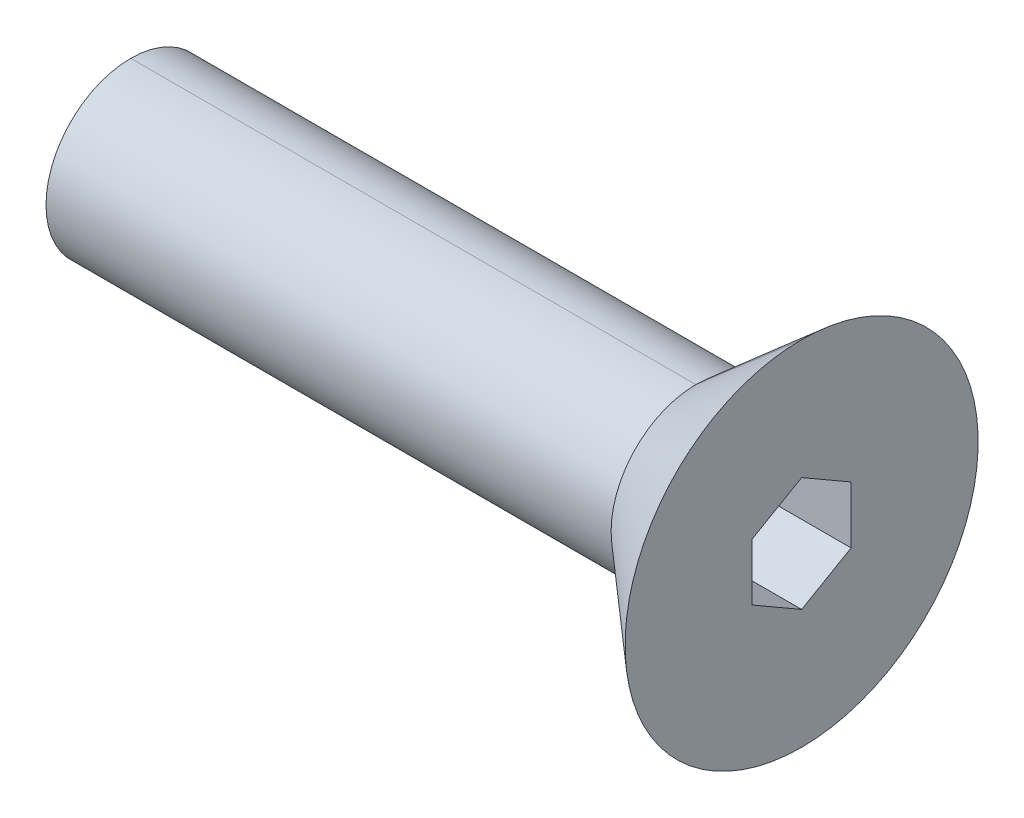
ISO-10303-21;
HEADER;
FILE_DESCRIPTION(('STEP AP214'),'2;1');
FILE_NAME('part.step','',(''),(''),'','','');
FILE_SCHEMA(('AUTOMOTIVE_DESIGN { 1 0 10303 214 1 1 1 1 }'));
ENDSEC;
DATA;
#1=APPLICATION_CONTEXT('core data for automotive mechanical design processes');
#2=APPLICATION_PROTOCOL_DEFINITION('international standard','automotive_design',2000,#1);
#3=PRODUCT_CONTEXT('',#1,'mechanical');
#4=PRODUCT('Part','Part','',(#3));
#5=PRODUCT_RELATED_PRODUCT_CATEGORY('part','',(#4));
#6=PRODUCT_DEFINITION_FORMATION('','',#4);
#7=PRODUCT_DEFINITION_CONTEXT('part definition',#1,'design');
#8=PRODUCT_DEFINITION('design','',#6,#7);
#9=PRODUCT_DEFINITION_SHAPE('','',#8);
#10=(LENGTH_UNIT() NAMED_UNIT(*) SI_UNIT(.MILLI.,.METRE.));
#11=(NAMED_UNIT(*) PLANE_ANGLE_UNIT() SI_UNIT($,.RADIAN.));
#12=(NAMED_UNIT(*) SI_UNIT($,.STERADIAN.) SOLID_ANGLE_UNIT());
#13=UNCERTAINTY_MEASURE_WITH_UNIT(LENGTH_MEASURE(1.E-05),#10,'distance_accuracy_value','');
#14=(GEOMETRIC_REPRESENTATION_CONTEXT(3) GLOBAL_UNCERTAINTY_ASSIGNED_CONTEXT((#13)) GLOBAL_UNIT_ASSIGNED_CONTEXT((#10,
#11,#12)) REPRESENTATION_CONTEXT('',''));
#15=CARTESIAN_POINT('',(0.,0.,0.));
#16=DIRECTION('',(0.,0.,1.));
#17=DIRECTION('',(1.,0.,0.));
#18=AXIS2_PLACEMENT_3D('',#15,#16,#17);
#19=CARTESIAN_POINT('',(13.2905499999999,0.,0.));
#20=DIRECTION('',(-1.,0.,0.));
#21=DIRECTION('',(0.,-1.,0.));
#22=AXIS2_PLACEMENT_3D('',#19,#20,#21);
#23=PLANE('',#22);
#24=DIRECTION('',(0.,0.500000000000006,-0.866025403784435));
#25=VECTOR('',#24,1.);
#26=CARTESIAN_POINT('',(13.2905499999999,-1.60395121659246,-2.778125));
#27=LINE('',#26,#25);
#28=CARTESIAN_POINT('',(13.2905499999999,-3.20790243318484,0.));
#29=VERTEX_POINT('',#28);
#30=CARTESIAN_POINT('',(13.2905499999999,-1.60395121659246,-2.778125));
#31=VERTEX_POINT('',#30);
#32=EDGE_CURVE('E135',#29,#31,#27,.T.);
#33=ORIENTED_EDGE('',*,*,#32,.T.);
#34=DIRECTION('',(0.,1.,0.));
#35=VECTOR('',#34,1.);
#36=CARTESIAN_POINT('',(13.2905499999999,1.60395121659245,-2.778125));
#37=LINE('',#36,#35);
#38=CARTESIAN_POINT('',(13.2905499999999,1.60395121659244,-2.77812499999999));
#39=VERTEX_POINT('',#38);
#40=EDGE_CURVE('E139',#31,#39,#37,.T.);
#41=ORIENTED_EDGE('',*,*,#40,.T.);
#42=DIRECTION('',(0.,0.500000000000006,0.866025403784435));
#43=VECTOR('',#42,1.);
#44=CARTESIAN_POINT('',(13.2905499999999,3.20790243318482,0.));
#45=LINE('',#44,#43);
#46=CARTESIAN_POINT('',(13.2905499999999,3.20790243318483,0.));
#47=VERTEX_POINT('',#46);
#48=EDGE_CURVE('E103',#39,#47,#45,.T.);
#49=ORIENTED_EDGE('',*,*,#48,.T.);
#50=DIRECTION('',(0.,-0.499999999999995,0.866025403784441));
#51=VECTOR('',#50,1.);
#52=CARTESIAN_POINT('',(13.2905499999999,1.60395121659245,2.778125));
#53=LINE('',#52,#51);
#54=CARTESIAN_POINT('',(13.2905499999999,1.60395121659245,2.778125));
#55=VERTEX_POINT('',#54);
#56=EDGE_CURVE('E104',#47,#55,#53,.T.);
#57=ORIENTED_EDGE('',*,*,#56,.T.);
#58=DIRECTION('',(0.,1.,0.));
#59=VECTOR('',#58,1.);
#60=CARTESIAN_POINT('',(13.2905499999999,-1.60395121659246,2.778125));
#61=LINE('',#60,#59);
#62=CARTESIAN_POINT('',(13.2905499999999,-1.60395121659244,2.77812499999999));
#63=VERTEX_POINT('',#62);
#64=EDGE_CURVE('E100',#55,#63,#61,.F.);
#65=ORIENTED_EDGE('',*,*,#64,.T.);
#66=DIRECTION('',(0.,-0.500000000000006,-0.866025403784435));
#67=VECTOR('',#66,1.);
#68=CARTESIAN_POINT('',(13.2905499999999,-3.20790243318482,0.));
#69=LINE('',#68,#67);
#70=EDGE_CURVE('E121',#63,#29,#69,.T.);
#71=ORIENTED_EDGE('',*,*,#70,.T.);
#72=EDGE_LOOP('',(#33,#41,#49,#57,#65,#71));
#73=FACE_BOUND('',#72,.T.);
#74=ADVANCED_FACE('F16',(#73),#23,.F.);
#75=CARTESIAN_POINT('',(13.2905499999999,-1.60395121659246,2.778125));
#76=DIRECTION('',(0.,0.,1.));
#77=DIRECTION('',(1.,0.,0.));
#78=AXIS2_PLACEMENT_3D('',#75,#76,#77);
#79=PLANE('',#78);
#80=DIRECTION('',(1.,0.,0.));
#81=VECTOR('',#80,1.);
#82=CARTESIAN_POINT('',(13.2905499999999,-1.60395121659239,2.77812499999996));
#83=LINE('',#82,#81);
#84=CARTESIAN_POINT('',(18.8467999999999,-1.60395121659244,2.77812499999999));
#85=VERTEX_POINT('',#84);
#86=EDGE_CURVE('E131',#85,#63,#83,.F.);
#87=ORIENTED_EDGE('',*,*,#86,.T.);
#88=ORIENTED_EDGE('',*,*,#64,.F.);
#89=DIRECTION('',(1.,0.,0.));
#90=VECTOR('',#89,1.);
#91=CARTESIAN_POINT('',(13.2905499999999,1.60395121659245,2.778125));
#92=LINE('',#91,#90);
#93=CARTESIAN_POINT('',(18.8467999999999,1.60395121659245,2.778125));
#94=VERTEX_POINT('',#93);
#95=EDGE_CURVE('E97',#55,#94,#92,.T.);
#96=ORIENTED_EDGE('',*,*,#95,.T.);
#97=DIRECTION('',(0.,1.,0.));
#98=VECTOR('',#97,1.);
#99=CARTESIAN_POINT('',(18.8467999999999,4.95934999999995,2.778125));
#100=LINE('',#99,#98);
#101=EDGE_CURVE('E93',#85,#94,#100,.T.);
#102=ORIENTED_EDGE('',*,*,#101,.F.);
#103=EDGE_LOOP('',(#87,#88,#96,#102));
#104=FACE_BOUND('',#103,.T.);
#105=ADVANCED_FACE('F99',(#104),#79,.F.);
#106=CARTESIAN_POINT('',(13.2905499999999,1.60395121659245,2.778125));
#107=DIRECTION('',(0.,0.866025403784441,0.499999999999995));
#108=DIRECTION('',(0.,-0.499999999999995,0.866025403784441));
#109=AXIS2_PLACEMENT_3D('',#106,#107,#108);
#110=PLANE('',#109);
#111=ORIENTED_EDGE('',*,*,#95,.F.);
#112=ORIENTED_EDGE('',*,*,#56,.F.);
#113=DIRECTION('',(1.,0.,0.));
#114=VECTOR('',#113,1.);
#115=CARTESIAN_POINT('',(13.2905499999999,3.20790243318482,0.));
#116=LINE('',#115,#114);
#117=CARTESIAN_POINT('',(18.8467999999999,3.20790243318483,0.));
#118=VERTEX_POINT('',#117);
#119=EDGE_CURVE('E110',#47,#118,#116,.T.);
#120=ORIENTED_EDGE('',*,*,#119,.T.);
#121=DIRECTION('',(0.,0.499999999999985,-0.866025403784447));
#122=VECTOR('',#121,1.);
#123=CARTESIAN_POINT('',(18.8467999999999,1.60395121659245,2.778125));
#124=LINE('',#123,#122);
#125=EDGE_CURVE('E107',#94,#118,#124,.T.);
#126=ORIENTED_EDGE('',*,*,#125,.F.);
#127=EDGE_LOOP('',(#111,#112,#120,#126));
#128=FACE_BOUND('',#127,.T.);
#129=ADVANCED_FACE('F108',(#128),#110,.F.);
#130=CARTESIAN_POINT('',(13.2905499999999,3.20790243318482,0.));
#131=DIRECTION('',(0.,0.866025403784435,-0.500000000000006));
#132=DIRECTION('',(0.,0.500000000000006,0.866025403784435));
#133=AXIS2_PLACEMENT_3D('',#130,#131,#132);
#134=PLANE('',#133);
#135=ORIENTED_EDGE('',*,*,#119,.F.);
#136=ORIENTED_EDGE('',*,*,#48,.F.);
#137=DIRECTION('',(-1.,0.,0.));
#138=VECTOR('',#137,1.);
#139=CARTESIAN_POINT('',(13.2905499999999,1.60395121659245,-2.778125));
#140=LINE('',#139,#138);
#141=CARTESIAN_POINT('',(18.8467999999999,1.60395121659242,-2.77812499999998));
#142=VERTEX_POINT('',#141);
#143=EDGE_CURVE('E137',#39,#142,#140,.F.);
#144=ORIENTED_EDGE('',*,*,#143,.T.);
#145=DIRECTION('',(0.,-0.499999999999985,-0.866025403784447));
#146=VECTOR('',#145,1.);
#147=CARTESIAN_POINT('',(18.8467999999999,3.20790243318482,0.));
#148=LINE('',#147,#146);
#149=EDGE_CURVE('E114',#118,#142,#148,.T.);
#150=ORIENTED_EDGE('',*,*,#149,.F.);
#151=EDGE_LOOP('',(#135,#136,#144,#150));
#152=FACE_BOUND('',#151,.T.);
#153=ADVANCED_FACE('F177',(#152),#134,.F.);
#154=CARTESIAN_POINT('',(13.2905499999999,1.60395121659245,-2.778125));
#155=DIRECTION('',(0.,0.,-1.));
#156=DIRECTION('',(-1.,0.,0.));
#157=AXIS2_PLACEMENT_3D('',#154,#155,#156);
#158=PLANE('',#157);
#159=ORIENTED_EDGE('',*,*,#143,.F.);
#160=ORIENTED_EDGE('',*,*,#40,.F.);
#161=DIRECTION('',(1.,0.,0.));
#162=VECTOR('',#161,1.);
#163=CARTESIAN_POINT('',(13.2905499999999,-1.60395121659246,-2.778125));
#164=LINE('',#163,#162);
#165=CARTESIAN_POINT('',(18.8467999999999,-1.60395121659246,-2.778125));
#166=VERTEX_POINT('',#165);
#167=EDGE_CURVE('E133',#31,#166,#164,.T.);
#168=ORIENTED_EDGE('',*,*,#167,.T.);
#169=DIRECTION('',(0.,1.,0.));
#170=VECTOR('',#169,1.);
#171=CARTESIAN_POINT('',(18.8467999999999,4.95934999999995,-2.778125));
#172=LINE('',#171,#170);
#173=EDGE_CURVE('E173',#142,#166,#172,.F.);
#174=ORIENTED_EDGE('',*,*,#173,.F.);
#175=EDGE_LOOP('',(#159,#160,#168,#174));
#176=FACE_BOUND('',#175,.T.);
#177=ADVANCED_FACE('F182',(#176),#158,.F.);
#178=CARTESIAN_POINT('',(13.2905499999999,-1.60395121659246,-2.778125));
#179=DIRECTION('',(0.,-0.866025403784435,-0.500000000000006));
#180=DIRECTION('',(0.,0.500000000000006,-0.866025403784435));
#181=AXIS2_PLACEMENT_3D('',#178,#179,#180);
#182=PLANE('',#181);
#183=ORIENTED_EDGE('',*,*,#167,.F.);
#184=ORIENTED_EDGE('',*,*,#32,.F.);
#185=DIRECTION('',(1.,0.,0.));
#186=VECTOR('',#185,1.);
#187=CARTESIAN_POINT('',(13.2905499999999,-3.20790243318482,0.));
#188=LINE('',#187,#186);
#189=CARTESIAN_POINT('',(18.8467999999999,-3.20790243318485,0.));
#190=VERTEX_POINT('',#189);
#191=EDGE_CURVE('E78',#29,#190,#188,.T.);
#192=ORIENTED_EDGE('',*,*,#191,.T.);
#193=DIRECTION('',(0.,-0.499999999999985,0.866025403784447));
#194=VECTOR('',#193,1.);
#195=CARTESIAN_POINT('',(18.8467999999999,-1.60395121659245,-2.778125));
#196=LINE('',#195,#194);
#197=EDGE_CURVE('E171',#166,#190,#196,.T.);
#198=ORIENTED_EDGE('',*,*,#197,.F.);
#199=EDGE_LOOP('',(#183,#184,#192,#198));
#200=FACE_BOUND('',#199,.T.);
#201=ADVANCED_FACE('F184',(#200),#182,.F.);
#202=CARTESIAN_POINT('',(13.2905499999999,-3.20790243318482,0.));
#203=DIRECTION('',(0.,-0.866025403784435,0.500000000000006));
#204=DIRECTION('',(0.,-0.500000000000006,-0.866025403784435));
#205=AXIS2_PLACEMENT_3D('',#202,#203,#204);
#206=PLANE('',#205);
#207=ORIENTED_EDGE('',*,*,#191,.F.);
#208=ORIENTED_EDGE('',*,*,#70,.F.);
#209=ORIENTED_EDGE('',*,*,#86,.F.);
#210=DIRECTION('',(0.,0.499999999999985,0.866025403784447));
#211=VECTOR('',#210,1.);
#212=CARTESIAN_POINT('',(18.8467999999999,-3.20790243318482,0.));
#213=LINE('',#212,#211);
#214=EDGE_CURVE('E119',#190,#85,#213,.T.);
#215=ORIENTED_EDGE('',*,*,#214,.F.);
#216=EDGE_LOOP('',(#207,#208,#209,#215));
#217=FACE_BOUND('',#216,.T.);
#218=ADVANCED_FACE('F186',(#217),#206,.F.);
#219=CARTESIAN_POINT('',(18.8467999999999,4.95934999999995,0.));
#220=DIRECTION('',(1.,0.,0.));
#221=DIRECTION('',(0.,0.,-1.));
#222=AXIS2_PLACEMENT_3D('',#219,#220,#221);
#223=PLANE('',#222);
#224=CARTESIAN_POINT('',(18.8468,0.,0.));
#225=DIRECTION('',(1.,0.,0.));
#226=DIRECTION('',(0.,1.,0.));
#227=AXIS2_PLACEMENT_3D('',#224,#225,#226);
#228=CIRCLE('',#227,9.91869999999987);
#229=CARTESIAN_POINT('',(18.8468,-9.91869999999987,0.));
#230=VERTEX_POINT('',#229);
#231=CARTESIAN_POINT('',(18.8468,9.91869999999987,0.));
#232=VERTEX_POINT('',#231);
#233=EDGE_CURVE('E19',#230,#232,#228,.F.);
#234=ORIENTED_EDGE('',*,*,#233,.F.);
#235=CARTESIAN_POINT('',(18.8468,0.,0.));
#236=DIRECTION('',(1.,0.,0.));
#237=DIRECTION('',(0.,1.,0.));
#238=AXIS2_PLACEMENT_3D('',#235,#236,#237);
#239=CIRCLE('',#238,9.91869999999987);
#240=EDGE_CURVE('E126',#232,#230,#239,.F.);
#241=ORIENTED_EDGE('',*,*,#240,.F.);
#242=EDGE_LOOP('',(#234,#241));
#243=FACE_BOUND('',#242,.T.);
#244=ORIENTED_EDGE('',*,*,#197,.T.);
#245=ORIENTED_EDGE('',*,*,#214,.T.);
#246=ORIENTED_EDGE('',*,*,#101,.T.);
#247=ORIENTED_EDGE('',*,*,#125,.T.);
#248=ORIENTED_EDGE('',*,*,#149,.T.);
#249=ORIENTED_EDGE('',*,*,#173,.T.);
#250=EDGE_LOOP('',(#244,#245,#246,#247,#248,#249));
#251=FACE_BOUND('',#250,.T.);
#252=ADVANCED_FACE('F118',(#243,#251),#223,.T.);
#253=CARTESIAN_POINT('',(18.8468,0.,0.));
#254=DIRECTION('',(1.,0.,0.));
#255=DIRECTION('',(0.,1.,0.));
#256=AXIS2_PLACEMENT_3D('',#253,#254,#255);
#257=CONICAL_SURFACE('',#256,9.91869999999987,0.714578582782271);
#258=DIRECTION('',(-0.755369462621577,0.655299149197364,0.));
#259=VECTOR('',#258,1.);
#260=CARTESIAN_POINT('',(15.8750000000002,-7.34059999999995,0.));
#261=LINE('',#260,#259);
#262=CARTESIAN_POINT('',(12.9032000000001,-4.76249999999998,0.));
#263=VERTEX_POINT('',#262);
#264=EDGE_CURVE('E150',#230,#263,#261,.T.);
#265=ORIENTED_EDGE('',*,*,#264,.F.);
#266=ORIENTED_EDGE('',*,*,#233,.T.);
#267=DIRECTION('',(-0.755369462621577,-0.655299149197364,0.));
#268=VECTOR('',#267,1.);
#269=CARTESIAN_POINT('',(15.8750000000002,7.34059999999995,0.));
#270=LINE('',#269,#268);
#271=CARTESIAN_POINT('',(12.9032000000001,4.76249999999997,0.));
#272=VERTEX_POINT('',#271);
#273=EDGE_CURVE('E34',#272,#232,#270,.F.);
#274=ORIENTED_EDGE('',*,*,#273,.F.);
#275=CARTESIAN_POINT('',(12.9032000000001,0.,0.));
#276=DIRECTION('',(-1.,0.,0.));
#277=DIRECTION('',(0.,-1.,0.));
#278=AXIS2_PLACEMENT_3D('',#275,#276,#277);
#279=CIRCLE('',#278,4.7625);
#280=EDGE_CURVE('E151',#263,#272,#279,.T.);
#281=ORIENTED_EDGE('',*,*,#280,.F.);
#282=EDGE_LOOP('',(#265,#266,#274,#281));
#283=FACE_BOUND('',#282,.T.);
#284=ADVANCED_FACE('F214',(#283),#257,.T.);
#285=CARTESIAN_POINT('',(-18.8467999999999,0.,0.));
#286=DIRECTION('',(-1.,0.,0.));
#287=DIRECTION('',(0.,-1.,0.));
#288=AXIS2_PLACEMENT_3D('',#285,#286,#287);
#289=PLANE('',#288);
#290=CARTESIAN_POINT('',(-18.8467999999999,0.,0.));
#291=DIRECTION('',(-1.,0.,0.));
#292=DIRECTION('',(0.,-1.,0.));
#293=AXIS2_PLACEMENT_3D('',#290,#291,#292);
#294=CIRCLE('',#293,4.7625);
#295=CARTESIAN_POINT('',(-18.8467999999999,-4.7625,0.));
#296=VERTEX_POINT('',#295);
#297=CARTESIAN_POINT('',(-18.8467999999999,4.7625,0.));
#298=VERTEX_POINT('',#297);
#299=EDGE_CURVE('E145',#296,#298,#294,.F.);
#300=ORIENTED_EDGE('',*,*,#299,.F.);
#301=CARTESIAN_POINT('',(-18.8467999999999,0.,0.));
#302=DIRECTION('',(-1.,0.,0.));
#303=DIRECTION('',(0.,-1.,0.));
#304=AXIS2_PLACEMENT_3D('',#301,#302,#303);
#305=CIRCLE('',#304,4.7625);
#306=EDGE_CURVE('E127',#298,#296,#305,.F.);
#307=ORIENTED_EDGE('',*,*,#306,.F.);
#308=EDGE_LOOP('',(#300,#307));
#309=FACE_BOUND('',#308,.T.);
#310=ADVANCED_FACE('F211',(#309),#289,.T.);
#311=CARTESIAN_POINT('',(-2.97179999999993,0.,0.));
#312=DIRECTION('',(-1.,0.,0.));
#313=DIRECTION('',(0.,-1.,0.));
#314=AXIS2_PLACEMENT_3D('',#311,#312,#313);
#315=CYLINDRICAL_SURFACE('',#314,4.7625);
#316=DIRECTION('',(-1.,0.,0.));
#317=VECTOR('',#316,1.);
#318=CARTESIAN_POINT('',(-2.97179999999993,4.7625,0.));
#319=LINE('',#318,#317);
#320=EDGE_CURVE('E25',#298,#272,#319,.F.);
#321=ORIENTED_EDGE('',*,*,#320,.F.);
#322=ORIENTED_EDGE('',*,*,#306,.T.);
#323=DIRECTION('',(-1.,0.,0.));
#324=VECTOR('',#323,1.);
#325=CARTESIAN_POINT('',(-2.97179999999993,-4.7625,0.));
#326=LINE('',#325,#324);
#327=EDGE_CURVE('E148',#263,#296,#326,.T.);
#328=ORIENTED_EDGE('',*,*,#327,.F.);
#329=ORIENTED_EDGE('',*,*,#280,.T.);
#330=EDGE_LOOP('',(#321,#322,#328,#329));
#331=FACE_BOUND('',#330,.T.);
#332=ADVANCED_FACE('F204',(#331),#315,.T.);
#333=CARTESIAN_POINT('',(18.8468,0.,0.));
#334=DIRECTION('',(1.,0.,0.));
#335=DIRECTION('',(0.,1.,0.));
#336=AXIS2_PLACEMENT_3D('',#333,#334,#335);
#337=CONICAL_SURFACE('',#336,9.91869999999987,0.714578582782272);
#338=ORIENTED_EDGE('',*,*,#264,.T.);
#339=CARTESIAN_POINT('',(12.9032000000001,0.,0.));
#340=DIRECTION('',(-1.,0.,0.));
#341=DIRECTION('',(0.,-1.,0.));
#342=AXIS2_PLACEMENT_3D('',#339,#340,#341);
#343=CIRCLE('',#342,4.7625);
#344=EDGE_CURVE('E11',#272,#263,#343,.T.);
#345=ORIENTED_EDGE('',*,*,#344,.F.);
#346=ORIENTED_EDGE('',*,*,#273,.T.);
#347=ORIENTED_EDGE('',*,*,#240,.T.);
#348=EDGE_LOOP('',(#338,#345,#346,#347));
#349=FACE_BOUND('',#348,.T.);
#350=ADVANCED_FACE('F198',(#349),#337,.T.);
#351=CARTESIAN_POINT('',(-2.97179999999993,0.,0.));
#352=DIRECTION('',(-1.,0.,0.));
#353=DIRECTION('',(0.,-1.,0.));
#354=AXIS2_PLACEMENT_3D('',#351,#352,#353);
#355=CYLINDRICAL_SURFACE('',#354,4.7625);
#356=ORIENTED_EDGE('',*,*,#320,.T.);
#357=ORIENTED_EDGE('',*,*,#344,.T.);
#358=ORIENTED_EDGE('',*,*,#327,.T.);
#359=ORIENTED_EDGE('',*,*,#299,.T.);
#360=EDGE_LOOP('',(#356,#357,#358,#359));
#361=FACE_BOUND('',#360,.T.);
#362=ADVANCED_FACE('F196',(#361),#355,.T.);
#363=CLOSED_SHELL('',(#74,#105,#129,#153,#177,#201,#218,#252,#284,#310,#332,#350,#362));
#364=MANIFOLD_SOLID_BREP('B1',#363);
#365=ADVANCED_BREP_SHAPE_REPRESENTATION('',(#18,#364),#14);
#366=SHAPE_DEFINITION_REPRESENTATION(#9,#365);
ENDSEC;
END-ISO-10303-21;
